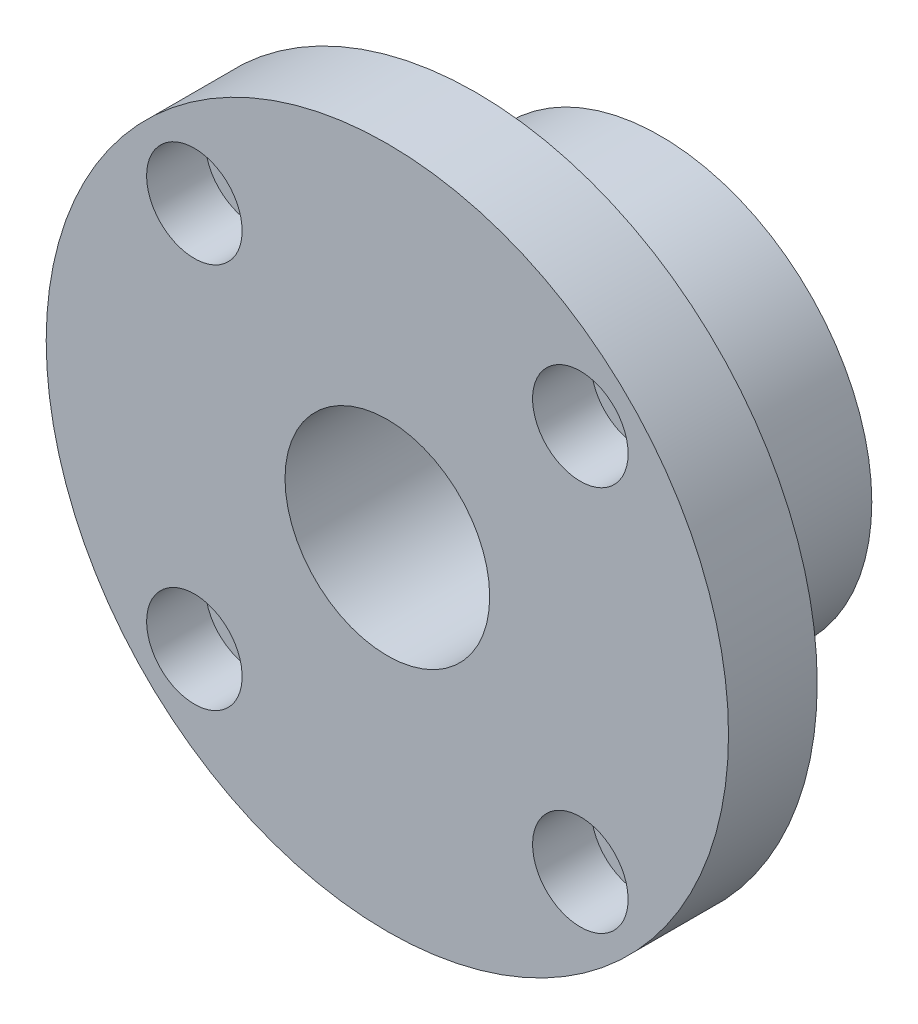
ISO-10303-21;
HEADER;
FILE_DESCRIPTION(('STEP AP214'),'2;1');
FILE_NAME('part.step','',(''),(''),'','','');
FILE_SCHEMA(('AUTOMOTIVE_DESIGN { 1 0 10303 214 1 1 1 1 }'));
ENDSEC;
DATA;
#1=APPLICATION_CONTEXT('core data for automotive mechanical design processes');
#2=APPLICATION_PROTOCOL_DEFINITION('international standard','automotive_design',2000,#1);
#3=PRODUCT_CONTEXT('',#1,'mechanical');
#4=PRODUCT('Part','Part','',(#3));
#5=PRODUCT_RELATED_PRODUCT_CATEGORY('part','',(#4));
#6=PRODUCT_DEFINITION_FORMATION('','',#4);
#7=PRODUCT_DEFINITION_CONTEXT('part definition',#1,'design');
#8=PRODUCT_DEFINITION('design','',#6,#7);
#9=PRODUCT_DEFINITION_SHAPE('','',#8);
#10=(LENGTH_UNIT() NAMED_UNIT(*) SI_UNIT(.MILLI.,.METRE.));
#11=(NAMED_UNIT(*) PLANE_ANGLE_UNIT() SI_UNIT($,.RADIAN.));
#12=(NAMED_UNIT(*) SI_UNIT($,.STERADIAN.) SOLID_ANGLE_UNIT());
#13=UNCERTAINTY_MEASURE_WITH_UNIT(LENGTH_MEASURE(1.E-05),#10,'distance_accuracy_value','');
#14=(GEOMETRIC_REPRESENTATION_CONTEXT(3) GLOBAL_UNCERTAINTY_ASSIGNED_CONTEXT((#13)) GLOBAL_UNIT_ASSIGNED_CONTEXT((#10,
#11,#12)) REPRESENTATION_CONTEXT('',''));
#15=CARTESIAN_POINT('',(0.,0.,0.));
#16=DIRECTION('',(0.,0.,1.));
#17=DIRECTION('',(1.,0.,0.));
#18=AXIS2_PLACEMENT_3D('',#15,#16,#17);
#19=CARTESIAN_POINT('',(0.,0.,0.));
#20=DIRECTION('',(0.,0.,1.));
#21=DIRECTION('',(1.,0.,0.));
#22=AXIS2_PLACEMENT_3D('',#19,#20,#21);
#23=PLANE('',#22);
#24=CARTESIAN_POINT('',(0.,0.,0.));
#25=DIRECTION('',(0.,0.,1.));
#26=DIRECTION('',(1.,0.,0.));
#27=AXIS2_PLACEMENT_3D('',#24,#25,#26);
#28=CIRCLE('',#27,50.);
#29=CARTESIAN_POINT('',(50.,0.,0.));
#30=VERTEX_POINT('',#29);
#31=EDGE_CURVE('E23',#30,#30,#28,.T.);
#32=ORIENTED_EDGE('',*,*,#31,.F.);
#33=EDGE_LOOP('',(#32));
#34=FACE_BOUND('',#33,.T.);
#35=CARTESIAN_POINT('',(28.2842712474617,28.2842712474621,0.));
#36=DIRECTION('',(0.,0.,1.));
#37=DIRECTION('',(1.,0.,0.));
#38=AXIS2_PLACEMENT_3D('',#35,#36,#37);
#39=CIRCLE('',#38,5.);
#40=CARTESIAN_POINT('',(33.2842712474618,28.2842712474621,0.));
#41=VERTEX_POINT('',#40);
#42=EDGE_CURVE('E35',#41,#41,#39,.T.);
#43=ORIENTED_EDGE('',*,*,#42,.T.);
#44=EDGE_LOOP('',(#43));
#45=FACE_BOUND('',#44,.T.);
#46=CARTESIAN_POINT('',(28.2842712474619,-28.2842712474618,0.));
#47=DIRECTION('',(0.,0.,1.));
#48=DIRECTION('',(0.,-1.,0.));
#49=AXIS2_PLACEMENT_3D('',#46,#47,#48);
#50=CIRCLE('',#49,5.);
#51=CARTESIAN_POINT('',(28.2842712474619,-33.2842712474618,0.));
#52=VERTEX_POINT('',#51);
#53=EDGE_CURVE('E75',#52,#52,#50,.T.);
#54=ORIENTED_EDGE('',*,*,#53,.T.);
#55=EDGE_LOOP('',(#54));
#56=FACE_BOUND('',#55,.T.);
#57=CARTESIAN_POINT('',(-28.2842712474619,-28.2842712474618,0.));
#58=DIRECTION('',(0.,0.,1.));
#59=DIRECTION('',(-1.,0.,0.));
#60=AXIS2_PLACEMENT_3D('',#57,#58,#59);
#61=CIRCLE('',#60,5.);
#62=CARTESIAN_POINT('',(-33.284271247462,-28.2842712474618,0.));
#63=VERTEX_POINT('',#62);
#64=EDGE_CURVE('E72',#63,#63,#61,.T.);
#65=ORIENTED_EDGE('',*,*,#64,.T.);
#66=EDGE_LOOP('',(#65));
#67=FACE_BOUND('',#66,.T.);
#68=CARTESIAN_POINT('',(-28.2842712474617,28.2842712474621,0.));
#69=DIRECTION('',(0.,0.,1.));
#70=DIRECTION('',(0.,1.,0.));
#71=AXIS2_PLACEMENT_3D('',#68,#69,#70);
#72=CIRCLE('',#71,5.);
#73=CARTESIAN_POINT('',(-28.2842712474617,33.2842712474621,0.));
#74=VERTEX_POINT('',#73);
#75=EDGE_CURVE('E40',#74,#74,#72,.T.);
#76=ORIENTED_EDGE('',*,*,#75,.T.);
#77=EDGE_LOOP('',(#76));
#78=FACE_BOUND('',#77,.T.);
#79=CARTESIAN_POINT('',(0.,0.,0.));
#80=DIRECTION('',(0.,0.,1.));
#81=DIRECTION('',(1.,0.,0.));
#82=AXIS2_PLACEMENT_3D('',#79,#80,#81);
#83=CIRCLE('',#82,31.);
#84=CARTESIAN_POINT('',(31.,0.,0.));
#85=VERTEX_POINT('',#84);
#86=EDGE_CURVE('E8',#85,#85,#83,.F.);
#87=ORIENTED_EDGE('',*,*,#86,.F.);
#88=EDGE_LOOP('',(#87));
#89=FACE_BOUND('',#88,.T.);
#90=ADVANCED_FACE('F12',(#34,#45,#56,#67,#78,#89),#23,.F.);
#91=CARTESIAN_POINT('',(-28.2842712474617,28.2842712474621,0.));
#92=DIRECTION('',(0.,0.,1.));
#93=DIRECTION('',(1.,0.,0.));
#94=AXIS2_PLACEMENT_3D('',#91,#92,#93);
#95=CYLINDRICAL_SURFACE('',#94,5.);
#96=ORIENTED_EDGE('',*,*,#75,.F.);
#97=EDGE_LOOP('',(#96));
#98=FACE_BOUND('',#97,.T.);
#99=CARTESIAN_POINT('',(-28.2842712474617,28.2842712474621,4.4));
#100=DIRECTION('',(0.,0.,1.));
#101=DIRECTION('',(1.,0.,0.));
#102=AXIS2_PLACEMENT_3D('',#99,#100,#101);
#103=CIRCLE('',#102,5.);
#104=CARTESIAN_POINT('',(-23.2842712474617,28.2842712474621,4.4));
#105=VERTEX_POINT('',#104);
#106=EDGE_CURVE('E46',#105,#105,#103,.F.);
#107=ORIENTED_EDGE('',*,*,#106,.F.);
#108=EDGE_LOOP('',(#107));
#109=FACE_BOUND('',#108,.T.);
#110=ADVANCED_FACE('F120',(#98,#109),#95,.F.);
#111=CARTESIAN_POINT('',(-28.2842712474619,-28.2842712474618,0.));
#112=DIRECTION('',(0.,0.,1.));
#113=DIRECTION('',(1.,0.,0.));
#114=AXIS2_PLACEMENT_3D('',#111,#112,#113);
#115=CYLINDRICAL_SURFACE('',#114,5.);
#116=ORIENTED_EDGE('',*,*,#64,.F.);
#117=EDGE_LOOP('',(#116));
#118=FACE_BOUND('',#117,.T.);
#119=CARTESIAN_POINT('',(-28.2842712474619,-28.2842712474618,4.4));
#120=DIRECTION('',(0.,0.,1.));
#121=DIRECTION('',(1.,0.,0.));
#122=AXIS2_PLACEMENT_3D('',#119,#120,#121);
#123=CIRCLE('',#122,5.);
#124=CARTESIAN_POINT('',(-23.2842712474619,-28.2842712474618,4.4));
#125=VERTEX_POINT('',#124);
#126=EDGE_CURVE('E42',#125,#125,#123,.F.);
#127=ORIENTED_EDGE('',*,*,#126,.F.);
#128=EDGE_LOOP('',(#127));
#129=FACE_BOUND('',#128,.T.);
#130=ADVANCED_FACE('F126',(#118,#129),#115,.F.);
#131=CARTESIAN_POINT('',(28.2842712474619,-28.2842712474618,0.));
#132=DIRECTION('',(0.,0.,1.));
#133=DIRECTION('',(1.,0.,0.));
#134=AXIS2_PLACEMENT_3D('',#131,#132,#133);
#135=CYLINDRICAL_SURFACE('',#134,5.);
#136=ORIENTED_EDGE('',*,*,#53,.F.);
#137=EDGE_LOOP('',(#136));
#138=FACE_BOUND('',#137,.T.);
#139=CARTESIAN_POINT('',(28.2842712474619,-28.2842712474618,4.4));
#140=DIRECTION('',(0.,0.,1.));
#141=DIRECTION('',(1.,0.,0.));
#142=AXIS2_PLACEMENT_3D('',#139,#140,#141);
#143=CIRCLE('',#142,5.);
#144=CARTESIAN_POINT('',(33.284271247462,-28.2842712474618,4.4));
#145=VERTEX_POINT('',#144);
#146=EDGE_CURVE('E37',#145,#145,#143,.F.);
#147=ORIENTED_EDGE('',*,*,#146,.F.);
#148=EDGE_LOOP('',(#147));
#149=FACE_BOUND('',#148,.T.);
#150=ADVANCED_FACE('F137',(#138,#149),#135,.F.);
#151=CARTESIAN_POINT('',(28.2842712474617,28.2842712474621,0.));
#152=DIRECTION('',(0.,0.,1.));
#153=DIRECTION('',(1.,0.,0.));
#154=AXIS2_PLACEMENT_3D('',#151,#152,#153);
#155=CYLINDRICAL_SURFACE('',#154,5.);
#156=ORIENTED_EDGE('',*,*,#42,.F.);
#157=EDGE_LOOP('',(#156));
#158=FACE_BOUND('',#157,.T.);
#159=CARTESIAN_POINT('',(28.2842712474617,28.2842712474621,4.4));
#160=DIRECTION('',(0.,0.,1.));
#161=DIRECTION('',(1.,0.,0.));
#162=AXIS2_PLACEMENT_3D('',#159,#160,#161);
#163=CIRCLE('',#162,5.);
#164=CARTESIAN_POINT('',(33.2842712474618,28.2842712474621,4.4));
#165=VERTEX_POINT('',#164);
#166=EDGE_CURVE('E32',#165,#165,#163,.F.);
#167=ORIENTED_EDGE('',*,*,#166,.F.);
#168=EDGE_LOOP('',(#167));
#169=FACE_BOUND('',#168,.T.);
#170=ADVANCED_FACE('F92',(#158,#169),#155,.F.);
#171=CARTESIAN_POINT('',(0.,0.,13.));
#172=DIRECTION('',(0.,0.,1.));
#173=DIRECTION('',(1.,0.,0.));
#174=AXIS2_PLACEMENT_3D('',#171,#172,#173);
#175=PLANE('',#174);
#176=CARTESIAN_POINT('',(0.,0.,13.));
#177=DIRECTION('',(0.,0.,1.));
#178=DIRECTION('',(1.,0.,0.));
#179=AXIS2_PLACEMENT_3D('',#176,#177,#178);
#180=CIRCLE('',#179,15.);
#181=CARTESIAN_POINT('',(15.,0.,13.));
#182=VERTEX_POINT('',#181);
#183=EDGE_CURVE('E28',#182,#182,#180,.T.);
#184=ORIENTED_EDGE('',*,*,#183,.F.);
#185=EDGE_LOOP('',(#184));
#186=FACE_BOUND('',#185,.T.);
#187=CARTESIAN_POINT('',(0.,0.,13.));
#188=DIRECTION('',(0.,0.,1.));
#189=DIRECTION('',(1.,0.,0.));
#190=AXIS2_PLACEMENT_3D('',#187,#188,#189);
#191=CIRCLE('',#190,50.);
#192=CARTESIAN_POINT('',(50.,0.,13.));
#193=VERTEX_POINT('',#192);
#194=EDGE_CURVE('E19',#193,#193,#191,.T.);
#195=ORIENTED_EDGE('',*,*,#194,.T.);
#196=EDGE_LOOP('',(#195));
#197=FACE_BOUND('',#196,.T.);
#198=CARTESIAN_POINT('',(28.2842712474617,28.2842712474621,13.));
#199=DIRECTION('',(0.,0.,1.));
#200=DIRECTION('',(1.,0.,0.));
#201=AXIS2_PLACEMENT_3D('',#198,#199,#200);
#202=CIRCLE('',#201,7.);
#203=CARTESIAN_POINT('',(35.2842712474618,28.2842712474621,13.));
#204=VERTEX_POINT('',#203);
#205=EDGE_CURVE('E78',#204,#204,#202,.T.);
#206=ORIENTED_EDGE('',*,*,#205,.F.);
#207=EDGE_LOOP('',(#206));
#208=FACE_BOUND('',#207,.T.);
#209=CARTESIAN_POINT('',(28.2842712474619,-28.2842712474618,13.));
#210=DIRECTION('',(0.,0.,1.));
#211=DIRECTION('',(0.,-1.,0.));
#212=AXIS2_PLACEMENT_3D('',#209,#210,#211);
#213=CIRCLE('',#212,7.);
#214=CARTESIAN_POINT('',(28.2842712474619,-35.2842712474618,13.));
#215=VERTEX_POINT('',#214);
#216=EDGE_CURVE('E44',#215,#215,#213,.T.);
#217=ORIENTED_EDGE('',*,*,#216,.F.);
#218=EDGE_LOOP('',(#217));
#219=FACE_BOUND('',#218,.T.);
#220=CARTESIAN_POINT('',(-28.2842712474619,-28.2842712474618,13.));
#221=DIRECTION('',(0.,0.,1.));
#222=DIRECTION('',(-1.,0.,0.));
#223=AXIS2_PLACEMENT_3D('',#220,#221,#222);
#224=CIRCLE('',#223,7.);
#225=CARTESIAN_POINT('',(-35.284271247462,-28.2842712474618,13.));
#226=VERTEX_POINT('',#225);
#227=EDGE_CURVE('E48',#226,#226,#224,.T.);
#228=ORIENTED_EDGE('',*,*,#227,.F.);
#229=EDGE_LOOP('',(#228));
#230=FACE_BOUND('',#229,.T.);
#231=CARTESIAN_POINT('',(-28.2842712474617,28.2842712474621,13.));
#232=DIRECTION('',(0.,0.,1.));
#233=DIRECTION('',(0.,1.,0.));
#234=AXIS2_PLACEMENT_3D('',#231,#232,#233);
#235=CIRCLE('',#234,7.);
#236=CARTESIAN_POINT('',(-28.2842712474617,35.2842712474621,13.));
#237=VERTEX_POINT('',#236);
#238=EDGE_CURVE('E55',#237,#237,#235,.T.);
#239=ORIENTED_EDGE('',*,*,#238,.F.);
#240=EDGE_LOOP('',(#239));
#241=FACE_BOUND('',#240,.T.);
#242=ADVANCED_FACE('F90',(#186,#197,#208,#219,#230,#241),#175,.T.);
#243=CARTESIAN_POINT('',(0.,0.,13.));
#244=DIRECTION('',(0.,0.,-1.));
#245=DIRECTION('',(-1.,0.,0.));
#246=AXIS2_PLACEMENT_3D('',#243,#244,#245);
#247=CYLINDRICAL_SURFACE('',#246,50.);
#248=ORIENTED_EDGE('',*,*,#194,.F.);
#249=EDGE_LOOP('',(#248));
#250=FACE_BOUND('',#249,.T.);
#251=ORIENTED_EDGE('',*,*,#31,.T.);
#252=EDGE_LOOP('',(#251));
#253=FACE_BOUND('',#252,.T.);
#254=ADVANCED_FACE('F14',(#250,#253),#247,.T.);
#255=CARTESIAN_POINT('',(0.,0.,13.));
#256=DIRECTION('',(0.,0.,-1.));
#257=DIRECTION('',(-1.,0.,0.));
#258=AXIS2_PLACEMENT_3D('',#255,#256,#257);
#259=CYLINDRICAL_SURFACE('',#258,15.);
#260=ORIENTED_EDGE('',*,*,#183,.T.);
#261=EDGE_LOOP('',(#260));
#262=FACE_BOUND('',#261,.T.);
#263=CARTESIAN_POINT('',(0.,0.,-27.));
#264=DIRECTION('',(0.,0.,-1.));
#265=DIRECTION('',(-1.,0.,0.));
#266=AXIS2_PLACEMENT_3D('',#263,#264,#265);
#267=CIRCLE('',#266,15.);
#268=CARTESIAN_POINT('',(-15.,0.,-27.));
#269=VERTEX_POINT('',#268);
#270=EDGE_CURVE('E292',#269,#269,#267,.T.);
#271=ORIENTED_EDGE('',*,*,#270,.T.);
#272=EDGE_LOOP('',(#271));
#273=FACE_BOUND('',#272,.T.);
#274=ADVANCED_FACE('F87',(#262,#273),#259,.F.);
#275=CARTESIAN_POINT('',(28.2842712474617,28.2842712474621,4.4));
#276=DIRECTION('',(0.,0.,1.));
#277=DIRECTION('',(1.,0.,0.));
#278=AXIS2_PLACEMENT_3D('',#275,#276,#277);
#279=PLANE('',#278);
#280=CARTESIAN_POINT('',(28.2842712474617,28.2842712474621,4.4));
#281=DIRECTION('',(0.,0.,1.));
#282=DIRECTION('',(1.,0.,0.));
#283=AXIS2_PLACEMENT_3D('',#280,#281,#282);
#284=CIRCLE('',#283,7.);
#285=CARTESIAN_POINT('',(35.2842712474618,28.2842712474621,4.4));
#286=VERTEX_POINT('',#285);
#287=EDGE_CURVE('E36',#286,#286,#284,.T.);
#288=ORIENTED_EDGE('',*,*,#287,.T.);
#289=EDGE_LOOP('',(#288));
#290=FACE_BOUND('',#289,.T.);
#291=ORIENTED_EDGE('',*,*,#166,.T.);
#292=EDGE_LOOP('',(#291));
#293=FACE_BOUND('',#292,.T.);
#294=ADVANCED_FACE('F134',(#290,#293),#279,.T.);
#295=CARTESIAN_POINT('',(28.2842712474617,28.2842712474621,4.4));
#296=DIRECTION('',(0.,0.,1.));
#297=DIRECTION('',(1.,0.,0.));
#298=AXIS2_PLACEMENT_3D('',#295,#296,#297);
#299=CYLINDRICAL_SURFACE('',#298,7.);
#300=ORIENTED_EDGE('',*,*,#287,.F.);
#301=EDGE_LOOP('',(#300));
#302=FACE_BOUND('',#301,.T.);
#303=ORIENTED_EDGE('',*,*,#205,.T.);
#304=EDGE_LOOP('',(#303));
#305=FACE_BOUND('',#304,.T.);
#306=ADVANCED_FACE('F139',(#302,#305),#299,.F.);
#307=CARTESIAN_POINT('',(28.2842712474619,-28.2842712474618,4.4));
#308=DIRECTION('',(0.,0.,1.));
#309=DIRECTION('',(0.,-1.,0.));
#310=AXIS2_PLACEMENT_3D('',#307,#308,#309);
#311=PLANE('',#310);
#312=CARTESIAN_POINT('',(28.2842712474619,-28.2842712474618,4.4));
#313=DIRECTION('',(0.,0.,1.));
#314=DIRECTION('',(0.,-1.,0.));
#315=AXIS2_PLACEMENT_3D('',#312,#313,#314);
#316=CIRCLE('',#315,7.);
#317=CARTESIAN_POINT('',(28.2842712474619,-35.2842712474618,4.4));
#318=VERTEX_POINT('',#317);
#319=EDGE_CURVE('E41',#318,#318,#316,.T.);
#320=ORIENTED_EDGE('',*,*,#319,.T.);
#321=EDGE_LOOP('',(#320));
#322=FACE_BOUND('',#321,.T.);
#323=ORIENTED_EDGE('',*,*,#146,.T.);
#324=EDGE_LOOP('',(#323));
#325=FACE_BOUND('',#324,.T.);
#326=ADVANCED_FACE('F142',(#322,#325),#311,.T.);
#327=CARTESIAN_POINT('',(28.2842712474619,-28.2842712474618,4.4));
#328=DIRECTION('',(0.,0.,1.));
#329=DIRECTION('',(1.,0.,0.));
#330=AXIS2_PLACEMENT_3D('',#327,#328,#329);
#331=CYLINDRICAL_SURFACE('',#330,7.);
#332=ORIENTED_EDGE('',*,*,#319,.F.);
#333=EDGE_LOOP('',(#332));
#334=FACE_BOUND('',#333,.T.);
#335=ORIENTED_EDGE('',*,*,#216,.T.);
#336=EDGE_LOOP('',(#335));
#337=FACE_BOUND('',#336,.T.);
#338=ADVANCED_FACE('F153',(#334,#337),#331,.F.);
#339=CARTESIAN_POINT('',(-28.2842712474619,-28.2842712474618,4.4));
#340=DIRECTION('',(0.,0.,1.));
#341=DIRECTION('',(-1.,0.,0.));
#342=AXIS2_PLACEMENT_3D('',#339,#340,#341);
#343=PLANE('',#342);
#344=CARTESIAN_POINT('',(-28.2842712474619,-28.2842712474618,4.4));
#345=DIRECTION('',(0.,0.,1.));
#346=DIRECTION('',(-1.,0.,0.));
#347=AXIS2_PLACEMENT_3D('',#344,#345,#346);
#348=CIRCLE('',#347,7.);
#349=CARTESIAN_POINT('',(-35.284271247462,-28.2842712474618,4.4));
#350=VERTEX_POINT('',#349);
#351=EDGE_CURVE('E45',#350,#350,#348,.T.);
#352=ORIENTED_EDGE('',*,*,#351,.T.);
#353=EDGE_LOOP('',(#352));
#354=FACE_BOUND('',#353,.T.);
#355=ORIENTED_EDGE('',*,*,#126,.T.);
#356=EDGE_LOOP('',(#355));
#357=FACE_BOUND('',#356,.T.);
#358=ADVANCED_FACE('F156',(#354,#357),#343,.T.);
#359=CARTESIAN_POINT('',(-28.2842712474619,-28.2842712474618,4.4));
#360=DIRECTION('',(0.,0.,1.));
#361=DIRECTION('',(1.,0.,0.));
#362=AXIS2_PLACEMENT_3D('',#359,#360,#361);
#363=CYLINDRICAL_SURFACE('',#362,7.);
#364=ORIENTED_EDGE('',*,*,#351,.F.);
#365=EDGE_LOOP('',(#364));
#366=FACE_BOUND('',#365,.T.);
#367=ORIENTED_EDGE('',*,*,#227,.T.);
#368=EDGE_LOOP('',(#367));
#369=FACE_BOUND('',#368,.T.);
#370=ADVANCED_FACE('F116',(#366,#369),#363,.F.);
#371=CARTESIAN_POINT('',(-28.2842712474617,28.2842712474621,4.4));
#372=DIRECTION('',(0.,0.,1.));
#373=DIRECTION('',(0.,1.,0.));
#374=AXIS2_PLACEMENT_3D('',#371,#372,#373);
#375=PLANE('',#374);
#376=CARTESIAN_POINT('',(-28.2842712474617,28.2842712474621,4.4));
#377=DIRECTION('',(0.,0.,1.));
#378=DIRECTION('',(0.,1.,0.));
#379=AXIS2_PLACEMENT_3D('',#376,#377,#378);
#380=CIRCLE('',#379,7.);
#381=CARTESIAN_POINT('',(-28.2842712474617,35.2842712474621,4.4));
#382=VERTEX_POINT('',#381);
#383=EDGE_CURVE('E49',#382,#382,#380,.T.);
#384=ORIENTED_EDGE('',*,*,#383,.T.);
#385=EDGE_LOOP('',(#384));
#386=FACE_BOUND('',#385,.T.);
#387=ORIENTED_EDGE('',*,*,#106,.T.);
#388=EDGE_LOOP('',(#387));
#389=FACE_BOUND('',#388,.T.);
#390=ADVANCED_FACE('F105',(#386,#389),#375,.T.);
#391=CARTESIAN_POINT('',(-28.2842712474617,28.2842712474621,4.4));
#392=DIRECTION('',(0.,0.,1.));
#393=DIRECTION('',(1.,0.,0.));
#394=AXIS2_PLACEMENT_3D('',#391,#392,#393);
#395=CYLINDRICAL_SURFACE('',#394,7.);
#396=ORIENTED_EDGE('',*,*,#383,.F.);
#397=EDGE_LOOP('',(#396));
#398=FACE_BOUND('',#397,.T.);
#399=ORIENTED_EDGE('',*,*,#238,.T.);
#400=EDGE_LOOP('',(#399));
#401=FACE_BOUND('',#400,.T.);
#402=ADVANCED_FACE('F102',(#398,#401),#395,.F.);
#403=CARTESIAN_POINT('',(0.,0.,-27.));
#404=DIRECTION('',(0.,0.,1.));
#405=DIRECTION('',(1.,0.,0.));
#406=AXIS2_PLACEMENT_3D('',#403,#404,#405);
#407=CYLINDRICAL_SURFACE('',#406,31.);
#408=CARTESIAN_POINT('',(0.,0.,-27.));
#409=DIRECTION('',(0.,0.,-1.));
#410=DIRECTION('',(-1.,0.,0.));
#411=AXIS2_PLACEMENT_3D('',#408,#409,#410);
#412=CIRCLE('',#411,31.);
#413=CARTESIAN_POINT('',(-31.,0.,-27.));
#414=VERTEX_POINT('',#413);
#415=EDGE_CURVE('E60',#414,#414,#412,.T.);
#416=ORIENTED_EDGE('',*,*,#415,.F.);
#417=EDGE_LOOP('',(#416));
#418=FACE_BOUND('',#417,.T.);
#419=ORIENTED_EDGE('',*,*,#86,.T.);
#420=EDGE_LOOP('',(#419));
#421=FACE_BOUND('',#420,.T.);
#422=ADVANCED_FACE('F104',(#418,#421),#407,.T.);
#423=CARTESIAN_POINT('',(0.,0.,-27.));
#424=DIRECTION('',(0.,0.,-1.));
#425=DIRECTION('',(-1.,0.,0.));
#426=AXIS2_PLACEMENT_3D('',#423,#424,#425);
#427=PLANE('',#426);
#428=ORIENTED_EDGE('',*,*,#415,.T.);
#429=EDGE_LOOP('',(#428));
#430=FACE_BOUND('',#429,.T.);
#431=ORIENTED_EDGE('',*,*,#270,.F.);
#432=EDGE_LOOP('',(#431));
#433=FACE_BOUND('',#432,.T.);
#434=ADVANCED_FACE('F113',(#430,#433),#427,.T.);
#435=CLOSED_SHELL('',(#90,#110,#130,#150,#170,#242,#254,#274,#294,#306,#326,#338,#358,#370,#390,
#402,#422,#434));
#436=MANIFOLD_SOLID_BREP('B1',#435);
#437=ADVANCED_BREP_SHAPE_REPRESENTATION('',(#18,#436),#14);
#438=SHAPE_DEFINITION_REPRESENTATION(#9,#437);
ENDSEC;
END-ISO-10303-21;
